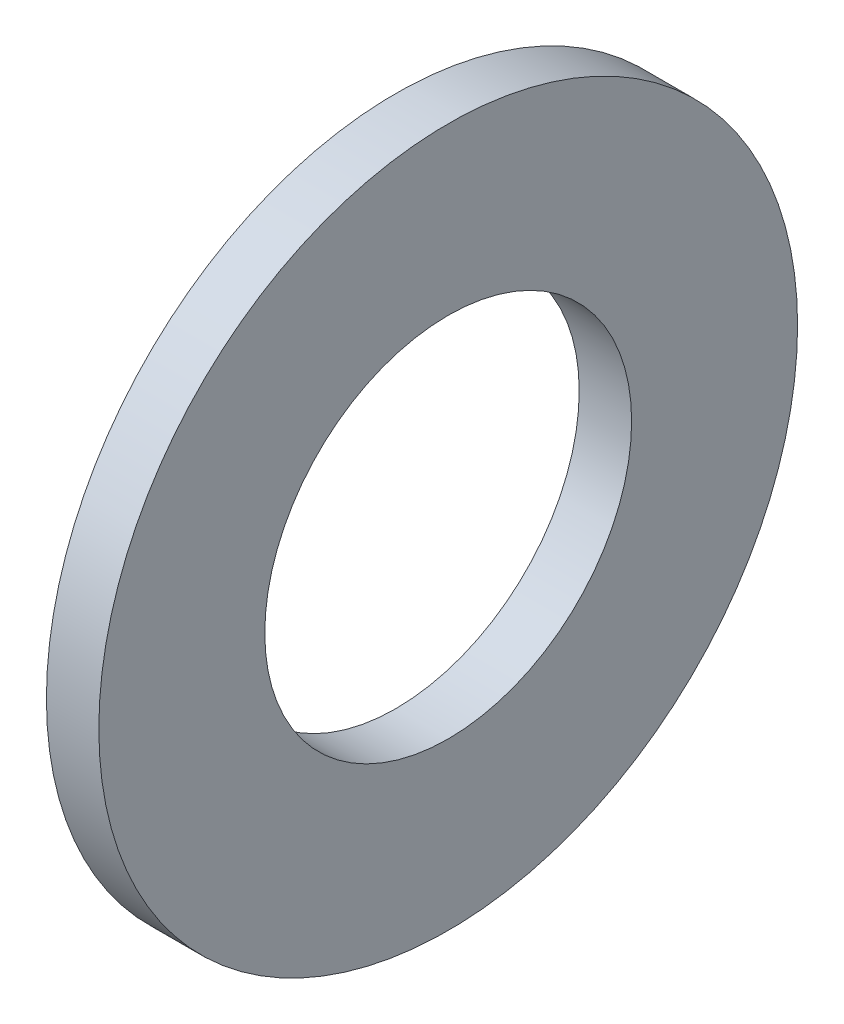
from build123d import *

# Parameters (mm, degrees)
ESQUISSE1_W = 3
ESQUISSE1_H = 9.5


with BuildPart() as part:
    # Esquisse1 → Base-R_volution (revolve)
    with BuildSketch(Plane(origin=(0, 0, 0), x_dir=(1, 0, 0), z_dir=(0, 1, 0)), mode=Mode.PRIVATE) as base_r_volution_sk:
        with Locations((1.5, 15.25)):
            Rectangle(ESQUISSE1_W, ESQUISSE1_H)
    revolve(base_r_volution_sk.sketch.rotate(Axis((0, 0, 0), (1, 0, 0)), 180), axis=Axis((0, 0, 0), (1, 0, 0)))


solid = part.part
